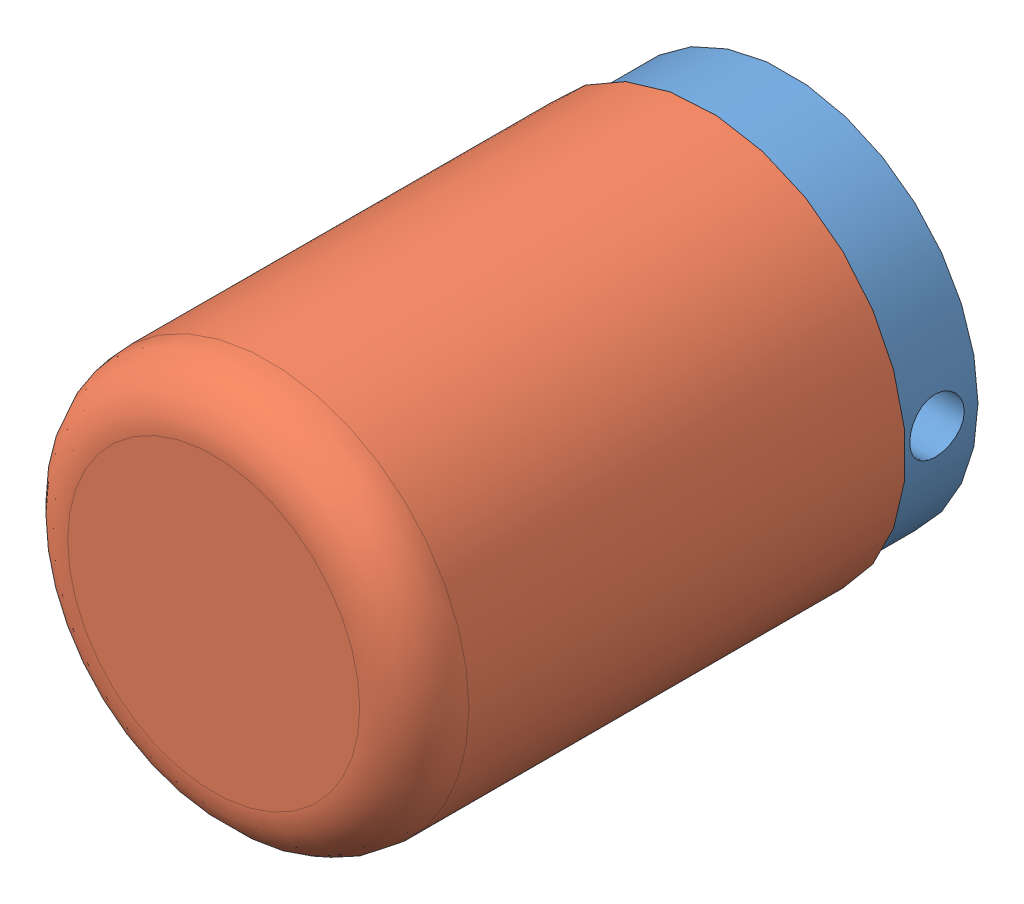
SolidWorks assembly MOTEUR STIRLING_91600.SLDASM, configuration Default (file format 10000). Lengths in mm.
Overall size (14.7 14.7 21).
2 component instances, 2 part files, 2 mates.
Components (placement in the parent):
- CUL DE PISTON-1: CUL DE PISTON.SLDPRT [Default] at (4.0668 7.4912 8.2319) size (14 14 6)
- PISTON DE LA SERINGUE EN VERRE 10cc-1: PISTON DE LA SERINGUE EN VERRE 10cc.SLDPRT [Default] at (4.0668 7.4912 27.2319) x (0 0 1) z (-1 0 0) size (18 14.7 14.7)
Mates (geometry in assembly coordinates):
- Coïncidente1: coincident anti-aligned: plane of CUL DE PISTON-1 through (4.0668 7.4912 11.2319) normal (0 0 1); plane of PISTON DE LA SERINGUE EN VERRE 10cc-1 through (4.0668 14.8412 11.2319) normal (0 0 -1)
- Coaxiale1: concentric aligned: cylinder of CUL DE PISTON-1 through (4.0668 7.4912 14.2319) axis (0 0 -1) radius 6; cylinder of PISTON DE LA SERINGUE EN VERRE 10cc-1 through (4.0668 7.4912 -15.9506) axis (0 0 -1) radius 7.35
